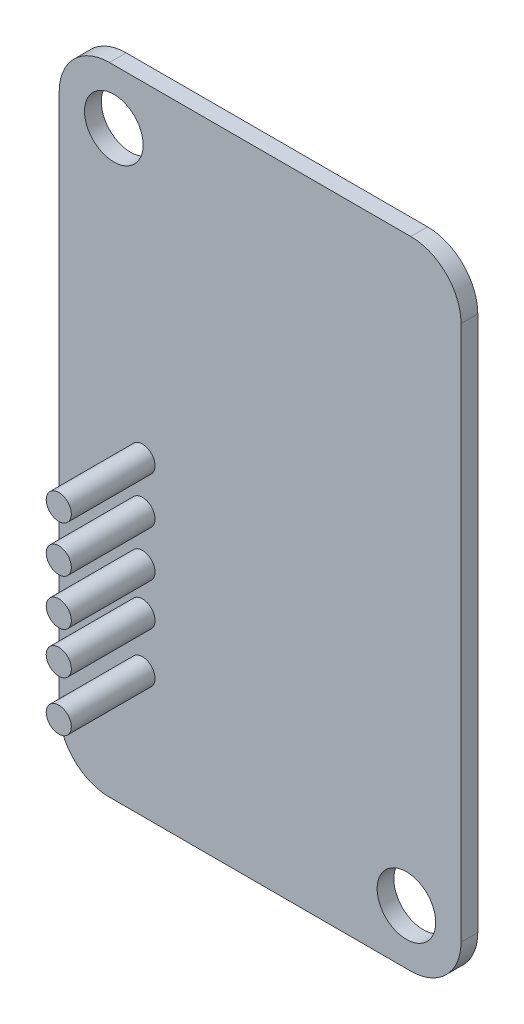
ISO-10303-21;
HEADER;
FILE_DESCRIPTION(('STEP AP214'),'2;1');
FILE_NAME('part.step','',(''),(''),'','','');
FILE_SCHEMA(('AUTOMOTIVE_DESIGN { 1 0 10303 214 1 1 1 1 }'));
ENDSEC;
DATA;
#1=APPLICATION_CONTEXT('core data for automotive mechanical design processes');
#2=APPLICATION_PROTOCOL_DEFINITION('international standard','automotive_design',2000,#1);
#3=PRODUCT_CONTEXT('',#1,'mechanical');
#4=PRODUCT('Part','Part','',(#3));
#5=PRODUCT_RELATED_PRODUCT_CATEGORY('part','',(#4));
#6=PRODUCT_DEFINITION_FORMATION('','',#4);
#7=PRODUCT_DEFINITION_CONTEXT('part definition',#1,'design');
#8=PRODUCT_DEFINITION('design','',#6,#7);
#9=PRODUCT_DEFINITION_SHAPE('','',#8);
#10=(LENGTH_UNIT() NAMED_UNIT(*) SI_UNIT(.MILLI.,.METRE.));
#11=(NAMED_UNIT(*) PLANE_ANGLE_UNIT() SI_UNIT($,.RADIAN.));
#12=(NAMED_UNIT(*) SI_UNIT($,.STERADIAN.) SOLID_ANGLE_UNIT());
#13=UNCERTAINTY_MEASURE_WITH_UNIT(LENGTH_MEASURE(1.E-05),#10,'distance_accuracy_value','');
#14=(GEOMETRIC_REPRESENTATION_CONTEXT(3) GLOBAL_UNCERTAINTY_ASSIGNED_CONTEXT((#13)) GLOBAL_UNIT_ASSIGNED_CONTEXT((#10,
#11,#12)) REPRESENTATION_CONTEXT('',''));
#15=CARTESIAN_POINT('',(0.,0.,0.));
#16=DIRECTION('',(0.,0.,1.));
#17=DIRECTION('',(1.,0.,0.));
#18=AXIS2_PLACEMENT_3D('',#15,#16,#17);
#19=CARTESIAN_POINT('',(0.,0.,0.));
#20=DIRECTION('',(0.,0.,-1.));
#21=DIRECTION('',(-1.,0.,0.));
#22=AXIS2_PLACEMENT_3D('',#19,#20,#21);
#23=PLANE('',#22);
#24=CARTESIAN_POINT('',(-7.02573050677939,-13.5,0.));
#25=DIRECTION('',(0.,0.,-1.));
#26=DIRECTION('',(-1.,0.,0.));
#27=AXIS2_PLACEMENT_3D('',#24,#25,#26);
#28=CIRCLE('',#27,0.75);
#29=CARTESIAN_POINT('',(-7.77573050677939,-13.5,0.));
#30=VERTEX_POINT('',#29);
#31=EDGE_CURVE('E11',#30,#30,#28,.T.);
#32=ORIENTED_EDGE('',*,*,#31,.F.);
#33=EDGE_LOOP('',(#32));
#34=FACE_BOUND('',#33,.T.);
#35=CARTESIAN_POINT('',(-7.02573050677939,-10.5078055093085,0.));
#36=DIRECTION('',(0.,0.,-1.));
#37=DIRECTION('',(-1.,0.,0.));
#38=AXIS2_PLACEMENT_3D('',#35,#36,#37);
#39=CIRCLE('',#38,0.750000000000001);
#40=CARTESIAN_POINT('',(-7.77573050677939,-10.5078055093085,0.));
#41=VERTEX_POINT('',#40);
#42=EDGE_CURVE('E42',#41,#41,#39,.T.);
#43=ORIENTED_EDGE('',*,*,#42,.F.);
#44=EDGE_LOOP('',(#43));
#45=FACE_BOUND('',#44,.T.);
#46=CARTESIAN_POINT('',(-7.02573050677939,-8.,0.));
#47=DIRECTION('',(0.,0.,-1.));
#48=DIRECTION('',(-1.,0.,0.));
#49=AXIS2_PLACEMENT_3D('',#46,#47,#48);
#50=CIRCLE('',#49,0.750000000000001);
#51=CARTESIAN_POINT('',(-7.77573050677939,-8.,0.));
#52=VERTEX_POINT('',#51);
#53=EDGE_CURVE('E403',#52,#52,#50,.T.);
#54=ORIENTED_EDGE('',*,*,#53,.F.);
#55=EDGE_LOOP('',(#54));
#56=FACE_BOUND('',#55,.T.);
#57=CARTESIAN_POINT('',(-7.02573050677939,-5.25566541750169,0.));
#58=DIRECTION('',(0.,0.,-1.));
#59=DIRECTION('',(-1.,0.,0.));
#60=AXIS2_PLACEMENT_3D('',#57,#58,#59);
#61=CIRCLE('',#60,0.749999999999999);
#62=CARTESIAN_POINT('',(-7.77573050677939,-5.25566541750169,0.));
#63=VERTEX_POINT('',#62);
#64=EDGE_CURVE('E409',#63,#63,#61,.T.);
#65=ORIENTED_EDGE('',*,*,#64,.F.);
#66=EDGE_LOOP('',(#65));
#67=FACE_BOUND('',#66,.T.);
#68=CARTESIAN_POINT('',(-7.02573050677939,-2.5,0.));
#69=DIRECTION('',(0.,0.,-1.));
#70=DIRECTION('',(-1.,0.,0.));
#71=AXIS2_PLACEMENT_3D('',#68,#69,#70);
#72=CIRCLE('',#71,0.749999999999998);
#73=CARTESIAN_POINT('',(-7.77573050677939,-2.5,0.));
#74=VERTEX_POINT('',#73);
#75=EDGE_CURVE('E371',#74,#74,#72,.T.);
#76=ORIENTED_EDGE('',*,*,#75,.F.);
#77=EDGE_LOOP('',(#76));
#78=FACE_BOUND('',#77,.T.);
#79=CARTESIAN_POINT('',(-8.73723825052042,13.7372382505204,0.));
#80=DIRECTION('',(0.,0.,-1.));
#81=DIRECTION('',(-1.,0.,0.));
#82=AXIS2_PLACEMENT_3D('',#79,#80,#81);
#83=CIRCLE('',#82,1.75);
#84=CARTESIAN_POINT('',(-10.4872382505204,13.7372382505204,0.));
#85=VERTEX_POINT('',#84);
#86=EDGE_CURVE('E425',#85,#85,#83,.T.);
#87=ORIENTED_EDGE('',*,*,#86,.F.);
#88=EDGE_LOOP('',(#87));
#89=FACE_BOUND('',#88,.T.);
#90=CARTESIAN_POINT('',(8.73723825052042,-17.7372382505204,0.));
#91=DIRECTION('',(0.,0.,-1.));
#92=DIRECTION('',(-1.,0.,0.));
#93=AXIS2_PLACEMENT_3D('',#90,#91,#92);
#94=CIRCLE('',#93,1.75);
#95=CARTESIAN_POINT('',(6.98723825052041,-17.7372382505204,0.));
#96=VERTEX_POINT('',#95);
#97=EDGE_CURVE('E375',#96,#96,#94,.T.);
#98=ORIENTED_EDGE('',*,*,#97,.F.);
#99=EDGE_LOOP('',(#98));
#100=FACE_BOUND('',#99,.T.);
#101=DIRECTION('',(1.,0.,0.));
#102=VECTOR('',#101,1.);
#103=CARTESIAN_POINT('',(-12.,-21.,0.));
#104=LINE('',#103,#102);
#105=CARTESIAN_POINT('',(-9.,-21.,0.));
#106=VERTEX_POINT('',#105);
#107=CARTESIAN_POINT('',(9.,-21.,0.));
#108=VERTEX_POINT('',#107);
#109=EDGE_CURVE('E331',#106,#108,#104,.T.);
#110=ORIENTED_EDGE('',*,*,#109,.F.);
#111=CARTESIAN_POINT('',(-9.,-18.,0.));
#112=DIRECTION('',(0.,0.,-1.));
#113=DIRECTION('',(-1.,0.,0.));
#114=AXIS2_PLACEMENT_3D('',#111,#112,#113);
#115=CIRCLE('',#114,3.);
#116=CARTESIAN_POINT('',(-12.,-18.,0.));
#117=VERTEX_POINT('',#116);
#118=EDGE_CURVE('E346',#106,#117,#115,.T.);
#119=ORIENTED_EDGE('',*,*,#118,.T.);
#120=DIRECTION('',(0.,-1.,0.));
#121=VECTOR('',#120,1.);
#122=CARTESIAN_POINT('',(-12.,17.,0.));
#123=LINE('',#122,#121);
#124=CARTESIAN_POINT('',(-12.,14.,0.));
#125=VERTEX_POINT('',#124);
#126=EDGE_CURVE('E328',#125,#117,#123,.T.);
#127=ORIENTED_EDGE('',*,*,#126,.F.);
#128=CARTESIAN_POINT('',(-9.,14.,0.));
#129=DIRECTION('',(0.,0.,-1.));
#130=DIRECTION('',(-1.,0.,0.));
#131=AXIS2_PLACEMENT_3D('',#128,#129,#130);
#132=CIRCLE('',#131,3.);
#133=CARTESIAN_POINT('',(-9.,17.,0.));
#134=VERTEX_POINT('',#133);
#135=EDGE_CURVE('E342',#125,#134,#132,.T.);
#136=ORIENTED_EDGE('',*,*,#135,.T.);
#137=DIRECTION('',(-1.,0.,0.));
#138=VECTOR('',#137,1.);
#139=CARTESIAN_POINT('',(-12.,17.,0.));
#140=LINE('',#139,#138);
#141=CARTESIAN_POINT('',(9.,17.,0.));
#142=VERTEX_POINT('',#141);
#143=EDGE_CURVE('E311',#142,#134,#140,.T.);
#144=ORIENTED_EDGE('',*,*,#143,.F.);
#145=CARTESIAN_POINT('',(9.,14.,0.));
#146=DIRECTION('',(0.,0.,-1.));
#147=DIRECTION('',(-1.,0.,0.));
#148=AXIS2_PLACEMENT_3D('',#145,#146,#147);
#149=CIRCLE('',#148,3.);
#150=CARTESIAN_POINT('',(12.,14.,0.));
#151=VERTEX_POINT('',#150);
#152=EDGE_CURVE('E340',#142,#151,#149,.T.);
#153=ORIENTED_EDGE('',*,*,#152,.T.);
#154=DIRECTION('',(0.,1.,0.));
#155=VECTOR('',#154,1.);
#156=CARTESIAN_POINT('',(12.,17.,0.));
#157=LINE('',#156,#155);
#158=CARTESIAN_POINT('',(12.,-18.,0.));
#159=VERTEX_POINT('',#158);
#160=EDGE_CURVE('E316',#159,#151,#157,.T.);
#161=ORIENTED_EDGE('',*,*,#160,.F.);
#162=CARTESIAN_POINT('',(9.,-18.,0.));
#163=DIRECTION('',(0.,0.,-1.));
#164=DIRECTION('',(-1.,0.,0.));
#165=AXIS2_PLACEMENT_3D('',#162,#163,#164);
#166=CIRCLE('',#165,3.);
#167=EDGE_CURVE('E344',#159,#108,#166,.T.);
#168=ORIENTED_EDGE('',*,*,#167,.T.);
#169=EDGE_LOOP('',(#110,#119,#127,#136,#144,#153,#161,#168));
#170=FACE_BOUND('',#169,.T.);
#171=DIRECTION('',(0.,-1.,0.));
#172=VECTOR('',#171,1.);
#173=CARTESIAN_POINT('',(-3.,1.5,0.));
#174=LINE('',#173,#172);
#175=CARTESIAN_POINT('',(-3.,1.5,0.));
#176=VERTEX_POINT('',#175);
#177=CARTESIAN_POINT('',(-3.,-1.5,0.));
#178=VERTEX_POINT('',#177);
#179=EDGE_CURVE('E296',#176,#178,#174,.T.);
#180=ORIENTED_EDGE('',*,*,#179,.F.);
#181=DIRECTION('',(1.,0.,0.));
#182=VECTOR('',#181,1.);
#183=CARTESIAN_POINT('',(-3.,1.5,0.));
#184=LINE('',#183,#182);
#185=CARTESIAN_POINT('',(-7.,1.5,0.));
#186=VERTEX_POINT('',#185);
#187=EDGE_CURVE('E282',#186,#176,#184,.T.);
#188=ORIENTED_EDGE('',*,*,#187,.F.);
#189=DIRECTION('',(0.,1.,0.));
#190=VECTOR('',#189,1.);
#191=CARTESIAN_POINT('',(-7.,1.5,0.));
#192=LINE('',#191,#190);
#193=CARTESIAN_POINT('',(-7.,-1.5,0.));
#194=VERTEX_POINT('',#193);
#195=EDGE_CURVE('E287',#194,#186,#192,.T.);
#196=ORIENTED_EDGE('',*,*,#195,.F.);
#197=DIRECTION('',(-1.,0.,0.));
#198=VECTOR('',#197,1.);
#199=CARTESIAN_POINT('',(-3.,-1.5,0.));
#200=LINE('',#199,#198);
#201=EDGE_CURVE('E298',#178,#194,#200,.T.);
#202=ORIENTED_EDGE('',*,*,#201,.F.);
#203=EDGE_LOOP('',(#180,#188,#196,#202));
#204=FACE_BOUND('',#203,.T.);
#205=DIRECTION('',(-1.,0.,0.));
#206=VECTOR('',#205,1.);
#207=CARTESIAN_POINT('',(1.5,3.,0.));
#208=LINE('',#207,#206);
#209=CARTESIAN_POINT('',(1.5,3.,0.));
#210=VERTEX_POINT('',#209);
#211=CARTESIAN_POINT('',(-1.5,3.,0.));
#212=VERTEX_POINT('',#211);
#213=EDGE_CURVE('E267',#210,#212,#208,.T.);
#214=ORIENTED_EDGE('',*,*,#213,.F.);
#215=DIRECTION('',(0.,-1.,0.));
#216=VECTOR('',#215,1.);
#217=CARTESIAN_POINT('',(1.5,3.,0.));
#218=LINE('',#217,#216);
#219=CARTESIAN_POINT('',(1.5,7.,0.));
#220=VERTEX_POINT('',#219);
#221=EDGE_CURVE('E253',#220,#210,#218,.T.);
#222=ORIENTED_EDGE('',*,*,#221,.F.);
#223=DIRECTION('',(1.,0.,0.));
#224=VECTOR('',#223,1.);
#225=CARTESIAN_POINT('',(1.5,7.,0.));
#226=LINE('',#225,#224);
#227=CARTESIAN_POINT('',(-1.5,7.,0.));
#228=VERTEX_POINT('',#227);
#229=EDGE_CURVE('E258',#228,#220,#226,.T.);
#230=ORIENTED_EDGE('',*,*,#229,.F.);
#231=DIRECTION('',(0.,1.,0.));
#232=VECTOR('',#231,1.);
#233=CARTESIAN_POINT('',(-1.5,3.,0.));
#234=LINE('',#233,#232);
#235=EDGE_CURVE('E269',#212,#228,#234,.T.);
#236=ORIENTED_EDGE('',*,*,#235,.F.);
#237=EDGE_LOOP('',(#214,#222,#230,#236));
#238=FACE_BOUND('',#237,.T.);
#239=DIRECTION('',(0.,-1.,0.));
#240=VECTOR('',#239,1.);
#241=CARTESIAN_POINT('',(7.,1.5,0.));
#242=LINE('',#241,#240);
#243=CARTESIAN_POINT('',(7.,1.5,0.));
#244=VERTEX_POINT('',#243);
#245=CARTESIAN_POINT('',(7.,-1.5,0.));
#246=VERTEX_POINT('',#245);
#247=EDGE_CURVE('E225',#244,#246,#242,.T.);
#248=ORIENTED_EDGE('',*,*,#247,.F.);
#249=DIRECTION('',(1.,0.,0.));
#250=VECTOR('',#249,1.);
#251=CARTESIAN_POINT('',(3.,1.5,0.));
#252=LINE('',#251,#250);
#253=CARTESIAN_POINT('',(3.,1.5,0.));
#254=VERTEX_POINT('',#253);
#255=EDGE_CURVE('E222',#254,#244,#252,.T.);
#256=ORIENTED_EDGE('',*,*,#255,.F.);
#257=DIRECTION('',(0.,1.,0.));
#258=VECTOR('',#257,1.);
#259=CARTESIAN_POINT('',(3.,1.5,0.));
#260=LINE('',#259,#258);
#261=CARTESIAN_POINT('',(3.,-1.5,0.));
#262=VERTEX_POINT('',#261);
#263=EDGE_CURVE('E234',#262,#254,#260,.T.);
#264=ORIENTED_EDGE('',*,*,#263,.F.);
#265=DIRECTION('',(-1.,0.,0.));
#266=VECTOR('',#265,1.);
#267=CARTESIAN_POINT('',(3.,-1.5,0.));
#268=LINE('',#267,#266);
#269=EDGE_CURVE('E242',#246,#262,#268,.T.);
#270=ORIENTED_EDGE('',*,*,#269,.F.);
#271=EDGE_LOOP('',(#248,#256,#264,#270));
#272=FACE_BOUND('',#271,.T.);
#273=DIRECTION('',(-1.,0.,0.));
#274=VECTOR('',#273,1.);
#275=CARTESIAN_POINT('',(1.5,-7.,0.));
#276=LINE('',#275,#274);
#277=CARTESIAN_POINT('',(1.5,-7.,0.));
#278=VERTEX_POINT('',#277);
#279=CARTESIAN_POINT('',(-1.5,-7.,0.));
#280=VERTEX_POINT('',#279);
#281=EDGE_CURVE('E437',#278,#280,#276,.T.);
#282=ORIENTED_EDGE('',*,*,#281,.F.);
#283=DIRECTION('',(0.,-1.,0.));
#284=VECTOR('',#283,1.);
#285=CARTESIAN_POINT('',(1.5,-3.,0.));
#286=LINE('',#285,#284);
#287=CARTESIAN_POINT('',(1.5,-3.,0.));
#288=VERTEX_POINT('',#287);
#289=EDGE_CURVE('E220',#288,#278,#286,.T.);
#290=ORIENTED_EDGE('',*,*,#289,.F.);
#291=DIRECTION('',(1.,0.,0.));
#292=VECTOR('',#291,1.);
#293=CARTESIAN_POINT('',(1.5,-3.,0.));
#294=LINE('',#293,#292);
#295=CARTESIAN_POINT('',(-1.5,-3.,0.));
#296=VERTEX_POINT('',#295);
#297=EDGE_CURVE('E216',#296,#288,#294,.T.);
#298=ORIENTED_EDGE('',*,*,#297,.F.);
#299=DIRECTION('',(0.,1.,0.));
#300=VECTOR('',#299,1.);
#301=CARTESIAN_POINT('',(-1.5,-3.,0.));
#302=LINE('',#301,#300);
#303=EDGE_CURVE('E439',#280,#296,#302,.T.);
#304=ORIENTED_EDGE('',*,*,#303,.F.);
#305=EDGE_LOOP('',(#282,#290,#298,#304));
#306=FACE_BOUND('',#305,.T.);
#307=ADVANCED_FACE('F33',(#34,#45,#56,#67,#78,#89,#100,#170,#204,#238,#272,#306),#23,.T.);
#308=CARTESIAN_POINT('',(-12.,17.,1.));
#309=DIRECTION('',(0.,-1.,0.));
#310=DIRECTION('',(1.,0.,0.));
#311=AXIS2_PLACEMENT_3D('',#308,#309,#310);
#312=PLANE('',#311);
#313=ORIENTED_EDGE('',*,*,#143,.T.);
#314=DIRECTION('',(0.,0.,-1.));
#315=VECTOR('',#314,1.);
#316=CARTESIAN_POINT('',(-9.,17.,1.));
#317=LINE('',#316,#315);
#318=CARTESIAN_POINT('',(-9.,17.,1.));
#319=VERTEX_POINT('',#318);
#320=EDGE_CURVE('E369',#134,#319,#317,.F.);
#321=ORIENTED_EDGE('',*,*,#320,.T.);
#322=DIRECTION('',(-1.,0.,0.));
#323=VECTOR('',#322,1.);
#324=CARTESIAN_POINT('',(-12.,17.,1.));
#325=LINE('',#324,#323);
#326=CARTESIAN_POINT('',(9.,17.,1.));
#327=VERTEX_POINT('',#326);
#328=EDGE_CURVE('E312',#327,#319,#325,.T.);
#329=ORIENTED_EDGE('',*,*,#328,.F.);
#330=DIRECTION('',(0.,0.,-1.));
#331=VECTOR('',#330,1.);
#332=CARTESIAN_POINT('',(9.,17.,1.));
#333=LINE('',#332,#331);
#334=EDGE_CURVE('E366',#327,#142,#333,.T.);
#335=ORIENTED_EDGE('',*,*,#334,.T.);
#336=EDGE_LOOP('',(#313,#321,#329,#335));
#337=FACE_BOUND('',#336,.T.);
#338=ADVANCED_FACE('F458',(#337),#312,.F.);
#339=CARTESIAN_POINT('',(-12.,17.,1.));
#340=DIRECTION('',(1.,0.,0.));
#341=DIRECTION('',(0.,1.,0.));
#342=AXIS2_PLACEMENT_3D('',#339,#340,#341);
#343=PLANE('',#342);
#344=ORIENTED_EDGE('',*,*,#126,.T.);
#345=DIRECTION('',(0.,0.,-1.));
#346=VECTOR('',#345,1.);
#347=CARTESIAN_POINT('',(-12.,-18.,1.));
#348=LINE('',#347,#346);
#349=CARTESIAN_POINT('',(-12.,-18.,1.));
#350=VERTEX_POINT('',#349);
#351=EDGE_CURVE('E351',#117,#350,#348,.F.);
#352=ORIENTED_EDGE('',*,*,#351,.T.);
#353=DIRECTION('',(0.,-1.,0.));
#354=VECTOR('',#353,1.);
#355=CARTESIAN_POINT('',(-12.,17.,1.));
#356=LINE('',#355,#354);
#357=CARTESIAN_POINT('',(-12.,14.,1.));
#358=VERTEX_POINT('',#357);
#359=EDGE_CURVE('E315',#358,#350,#356,.T.);
#360=ORIENTED_EDGE('',*,*,#359,.F.);
#361=DIRECTION('',(0.,0.,-1.));
#362=VECTOR('',#361,1.);
#363=CARTESIAN_POINT('',(-12.,14.,1.));
#364=LINE('',#363,#362);
#365=EDGE_CURVE('E348',#358,#125,#364,.T.);
#366=ORIENTED_EDGE('',*,*,#365,.T.);
#367=EDGE_LOOP('',(#344,#352,#360,#366));
#368=FACE_BOUND('',#367,.T.);
#369=ADVANCED_FACE('F466',(#368),#343,.F.);
#370=CARTESIAN_POINT('',(-12.,-21.,1.));
#371=DIRECTION('',(0.,1.,0.));
#372=DIRECTION('',(-1.,0.,0.));
#373=AXIS2_PLACEMENT_3D('',#370,#371,#372);
#374=PLANE('',#373);
#375=DIRECTION('',(1.,0.,0.));
#376=VECTOR('',#375,1.);
#377=CARTESIAN_POINT('',(-12.,-21.,1.));
#378=LINE('',#377,#376);
#379=CARTESIAN_POINT('',(-9.,-21.,1.));
#380=VERTEX_POINT('',#379);
#381=CARTESIAN_POINT('',(9.,-21.,1.));
#382=VERTEX_POINT('',#381);
#383=EDGE_CURVE('E319',#380,#382,#378,.T.);
#384=ORIENTED_EDGE('',*,*,#383,.F.);
#385=DIRECTION('',(0.,0.,-1.));
#386=VECTOR('',#385,1.);
#387=CARTESIAN_POINT('',(-9.,-21.,1.));
#388=LINE('',#387,#386);
#389=EDGE_CURVE('E337',#380,#106,#388,.T.);
#390=ORIENTED_EDGE('',*,*,#389,.T.);
#391=ORIENTED_EDGE('',*,*,#109,.T.);
#392=DIRECTION('',(0.,0.,-1.));
#393=VECTOR('',#392,1.);
#394=CARTESIAN_POINT('',(9.,-21.,1.));
#395=LINE('',#394,#393);
#396=EDGE_CURVE('E325',#108,#382,#395,.F.);
#397=ORIENTED_EDGE('',*,*,#396,.T.);
#398=EDGE_LOOP('',(#384,#390,#391,#397));
#399=FACE_BOUND('',#398,.T.);
#400=ADVANCED_FACE('F478',(#399),#374,.F.);
#401=CARTESIAN_POINT('',(12.,17.,1.));
#402=DIRECTION('',(-1.,0.,0.));
#403=DIRECTION('',(0.,-1.,0.));
#404=AXIS2_PLACEMENT_3D('',#401,#402,#403);
#405=PLANE('',#404);
#406=DIRECTION('',(0.,1.,0.));
#407=VECTOR('',#406,1.);
#408=CARTESIAN_POINT('',(12.,17.,1.));
#409=LINE('',#408,#407);
#410=CARTESIAN_POINT('',(12.,-18.,1.));
#411=VERTEX_POINT('',#410);
#412=CARTESIAN_POINT('',(12.,14.,1.));
#413=VERTEX_POINT('',#412);
#414=EDGE_CURVE('E322',#411,#413,#409,.T.);
#415=ORIENTED_EDGE('',*,*,#414,.F.);
#416=DIRECTION('',(0.,0.,-1.));
#417=VECTOR('',#416,1.);
#418=CARTESIAN_POINT('',(12.,-18.,1.));
#419=LINE('',#418,#417);
#420=EDGE_CURVE('E363',#411,#159,#419,.T.);
#421=ORIENTED_EDGE('',*,*,#420,.T.);
#422=ORIENTED_EDGE('',*,*,#160,.T.);
#423=DIRECTION('',(0.,0.,-1.));
#424=VECTOR('',#423,1.);
#425=CARTESIAN_POINT('',(12.,14.,1.));
#426=LINE('',#425,#424);
#427=EDGE_CURVE('E361',#151,#413,#426,.F.);
#428=ORIENTED_EDGE('',*,*,#427,.T.);
#429=EDGE_LOOP('',(#415,#421,#422,#428));
#430=FACE_BOUND('',#429,.T.);
#431=ADVANCED_FACE('F475',(#430),#405,.F.);
#432=CARTESIAN_POINT('',(0.,0.,1.));
#433=DIRECTION('',(0.,0.,-1.));
#434=DIRECTION('',(-1.,0.,0.));
#435=AXIS2_PLACEMENT_3D('',#432,#433,#434);
#436=PLANE('',#435);
#437=CARTESIAN_POINT('',(-7.02573050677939,-13.5,1.));
#438=DIRECTION('',(0.,0.,-1.));
#439=DIRECTION('',(-1.,0.,0.));
#440=AXIS2_PLACEMENT_3D('',#437,#438,#439);
#441=CIRCLE('',#440,0.75);
#442=CARTESIAN_POINT('',(-7.77573050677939,-13.5,1.));
#443=VERTEX_POINT('',#442);
#444=EDGE_CURVE('E37',#443,#443,#441,.T.);
#445=ORIENTED_EDGE('',*,*,#444,.T.);
#446=EDGE_LOOP('',(#445));
#447=FACE_BOUND('',#446,.T.);
#448=CARTESIAN_POINT('',(-7.02573050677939,-10.5078055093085,1.));
#449=DIRECTION('',(0.,0.,-1.));
#450=DIRECTION('',(-1.,0.,0.));
#451=AXIS2_PLACEMENT_3D('',#448,#449,#450);
#452=CIRCLE('',#451,0.750000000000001);
#453=CARTESIAN_POINT('',(-7.77573050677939,-10.5078055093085,1.));
#454=VERTEX_POINT('',#453);
#455=EDGE_CURVE('E386',#454,#454,#452,.T.);
#456=ORIENTED_EDGE('',*,*,#455,.T.);
#457=EDGE_LOOP('',(#456));
#458=FACE_BOUND('',#457,.T.);
#459=CARTESIAN_POINT('',(-7.02573050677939,-8.,1.));
#460=DIRECTION('',(0.,0.,-1.));
#461=DIRECTION('',(-1.,0.,0.));
#462=AXIS2_PLACEMENT_3D('',#459,#460,#461);
#463=CIRCLE('',#462,0.750000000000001);
#464=CARTESIAN_POINT('',(-7.77573050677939,-8.,1.));
#465=VERTEX_POINT('',#464);
#466=EDGE_CURVE('E382',#465,#465,#463,.T.);
#467=ORIENTED_EDGE('',*,*,#466,.T.);
#468=EDGE_LOOP('',(#467));
#469=FACE_BOUND('',#468,.T.);
#470=CARTESIAN_POINT('',(-7.02573050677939,-5.25566541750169,1.));
#471=DIRECTION('',(0.,0.,-1.));
#472=DIRECTION('',(-1.,0.,0.));
#473=AXIS2_PLACEMENT_3D('',#470,#471,#472);
#474=CIRCLE('',#473,0.749999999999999);
#475=CARTESIAN_POINT('',(-7.77573050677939,-5.25566541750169,1.));
#476=VERTEX_POINT('',#475);
#477=EDGE_CURVE('E377',#476,#476,#474,.T.);
#478=ORIENTED_EDGE('',*,*,#477,.T.);
#479=EDGE_LOOP('',(#478));
#480=FACE_BOUND('',#479,.T.);
#481=CARTESIAN_POINT('',(-7.02573050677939,-2.5,1.));
#482=DIRECTION('',(0.,0.,-1.));
#483=DIRECTION('',(-1.,0.,0.));
#484=AXIS2_PLACEMENT_3D('',#481,#482,#483);
#485=CIRCLE('',#484,0.749999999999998);
#486=CARTESIAN_POINT('',(-7.77573050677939,-2.5,1.));
#487=VERTEX_POINT('',#486);
#488=EDGE_CURVE('E372',#487,#487,#485,.T.);
#489=ORIENTED_EDGE('',*,*,#488,.T.);
#490=EDGE_LOOP('',(#489));
#491=FACE_BOUND('',#490,.T.);
#492=CARTESIAN_POINT('',(-8.73723825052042,13.7372382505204,1.));
#493=DIRECTION('',(0.,0.,-1.));
#494=DIRECTION('',(-1.,0.,0.));
#495=AXIS2_PLACEMENT_3D('',#492,#493,#494);
#496=CIRCLE('',#495,1.75);
#497=CARTESIAN_POINT('',(-10.4872382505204,13.7372382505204,1.));
#498=VERTEX_POINT('',#497);
#499=EDGE_CURVE('E422',#498,#498,#496,.T.);
#500=ORIENTED_EDGE('',*,*,#499,.T.);
#501=EDGE_LOOP('',(#500));
#502=FACE_BOUND('',#501,.T.);
#503=CARTESIAN_POINT('',(8.73723825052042,-17.7372382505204,1.));
#504=DIRECTION('',(0.,0.,-1.));
#505=DIRECTION('',(-1.,0.,0.));
#506=AXIS2_PLACEMENT_3D('',#503,#504,#505);
#507=CIRCLE('',#506,1.75);
#508=CARTESIAN_POINT('',(6.98723825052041,-17.7372382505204,1.));
#509=VERTEX_POINT('',#508);
#510=EDGE_CURVE('E428',#509,#509,#507,.T.);
#511=ORIENTED_EDGE('',*,*,#510,.T.);
#512=EDGE_LOOP('',(#511));
#513=FACE_BOUND('',#512,.T.);
#514=ORIENTED_EDGE('',*,*,#359,.T.);
#515=CARTESIAN_POINT('',(-9.,-18.,1.));
#516=DIRECTION('',(0.,0.,-1.));
#517=DIRECTION('',(-1.,0.,0.));
#518=AXIS2_PLACEMENT_3D('',#515,#516,#517);
#519=CIRCLE('',#518,3.);
#520=EDGE_CURVE('E359',#350,#380,#519,.F.);
#521=ORIENTED_EDGE('',*,*,#520,.T.);
#522=ORIENTED_EDGE('',*,*,#383,.T.);
#523=CARTESIAN_POINT('',(9.,-18.,1.));
#524=DIRECTION('',(0.,0.,-1.));
#525=DIRECTION('',(-1.,0.,0.));
#526=AXIS2_PLACEMENT_3D('',#523,#524,#525);
#527=CIRCLE('',#526,3.);
#528=EDGE_CURVE('E357',#382,#411,#527,.F.);
#529=ORIENTED_EDGE('',*,*,#528,.T.);
#530=ORIENTED_EDGE('',*,*,#414,.T.);
#531=CARTESIAN_POINT('',(9.,14.,1.));
#532=DIRECTION('',(0.,0.,-1.));
#533=DIRECTION('',(-1.,0.,0.));
#534=AXIS2_PLACEMENT_3D('',#531,#532,#533);
#535=CIRCLE('',#534,3.);
#536=EDGE_CURVE('E353',#413,#327,#535,.F.);
#537=ORIENTED_EDGE('',*,*,#536,.T.);
#538=ORIENTED_EDGE('',*,*,#328,.T.);
#539=CARTESIAN_POINT('',(-9.,14.,1.));
#540=DIRECTION('',(0.,0.,-1.));
#541=DIRECTION('',(-1.,0.,0.));
#542=AXIS2_PLACEMENT_3D('',#539,#540,#541);
#543=CIRCLE('',#542,3.);
#544=EDGE_CURVE('E355',#319,#358,#543,.F.);
#545=ORIENTED_EDGE('',*,*,#544,.T.);
#546=EDGE_LOOP('',(#514,#521,#522,#529,#530,#537,#538,#545));
#547=FACE_BOUND('',#546,.T.);
#548=ADVANCED_FACE('F473',(#447,#458,#469,#480,#491,#502,#513,#547),#436,.F.);
#549=CARTESIAN_POINT('',(-9.,-18.,1.));
#550=DIRECTION('',(0.,0.,-1.));
#551=DIRECTION('',(-1.,0.,0.));
#552=AXIS2_PLACEMENT_3D('',#549,#550,#551);
#553=CYLINDRICAL_SURFACE('',#552,3.);
#554=ORIENTED_EDGE('',*,*,#520,.F.);
#555=ORIENTED_EDGE('',*,*,#351,.F.);
#556=ORIENTED_EDGE('',*,*,#118,.F.);
#557=ORIENTED_EDGE('',*,*,#389,.F.);
#558=EDGE_LOOP('',(#554,#555,#556,#557));
#559=FACE_BOUND('',#558,.T.);
#560=ADVANCED_FACE('F486',(#559),#553,.T.);
#561=CARTESIAN_POINT('',(9.,-18.,1.));
#562=DIRECTION('',(0.,0.,-1.));
#563=DIRECTION('',(-1.,0.,0.));
#564=AXIS2_PLACEMENT_3D('',#561,#562,#563);
#565=CYLINDRICAL_SURFACE('',#564,3.);
#566=ORIENTED_EDGE('',*,*,#528,.F.);
#567=ORIENTED_EDGE('',*,*,#396,.F.);
#568=ORIENTED_EDGE('',*,*,#167,.F.);
#569=ORIENTED_EDGE('',*,*,#420,.F.);
#570=EDGE_LOOP('',(#566,#567,#568,#569));
#571=FACE_BOUND('',#570,.T.);
#572=ADVANCED_FACE('F489',(#571),#565,.T.);
#573=CARTESIAN_POINT('',(-9.,14.,1.));
#574=DIRECTION('',(0.,0.,-1.));
#575=DIRECTION('',(-1.,0.,0.));
#576=AXIS2_PLACEMENT_3D('',#573,#574,#575);
#577=CYLINDRICAL_SURFACE('',#576,3.);
#578=ORIENTED_EDGE('',*,*,#544,.F.);
#579=ORIENTED_EDGE('',*,*,#320,.F.);
#580=ORIENTED_EDGE('',*,*,#135,.F.);
#581=ORIENTED_EDGE('',*,*,#365,.F.);
#582=EDGE_LOOP('',(#578,#579,#580,#581));
#583=FACE_BOUND('',#582,.T.);
#584=ADVANCED_FACE('F492',(#583),#577,.T.);
#585=CARTESIAN_POINT('',(9.,14.,1.));
#586=DIRECTION('',(0.,0.,-1.));
#587=DIRECTION('',(-1.,0.,0.));
#588=AXIS2_PLACEMENT_3D('',#585,#586,#587);
#589=CYLINDRICAL_SURFACE('',#588,3.);
#590=ORIENTED_EDGE('',*,*,#536,.F.);
#591=ORIENTED_EDGE('',*,*,#427,.F.);
#592=ORIENTED_EDGE('',*,*,#152,.F.);
#593=ORIENTED_EDGE('',*,*,#334,.F.);
#594=EDGE_LOOP('',(#590,#591,#592,#593));
#595=FACE_BOUND('',#594,.T.);
#596=ADVANCED_FACE('F35',(#595),#589,.T.);
#597=CARTESIAN_POINT('',(-3.,1.5,-2.));
#598=DIRECTION('',(0.,-1.,0.));
#599=DIRECTION('',(1.,0.,0.));
#600=AXIS2_PLACEMENT_3D('',#597,#598,#599);
#601=PLANE('',#600);
#602=ORIENTED_EDGE('',*,*,#187,.T.);
#603=DIRECTION('',(0.,0.,1.));
#604=VECTOR('',#603,1.);
#605=CARTESIAN_POINT('',(-3.,1.5,-2.));
#606=LINE('',#605,#604);
#607=CARTESIAN_POINT('',(-3.,1.5,-2.));
#608=VERTEX_POINT('',#607);
#609=EDGE_CURVE('E309',#608,#176,#606,.T.);
#610=ORIENTED_EDGE('',*,*,#609,.F.);
#611=DIRECTION('',(1.,0.,0.));
#612=VECTOR('',#611,1.);
#613=CARTESIAN_POINT('',(-3.,1.5,-2.));
#614=LINE('',#613,#612);
#615=CARTESIAN_POINT('',(-7.,1.5,-2.));
#616=VERTEX_POINT('',#615);
#617=EDGE_CURVE('E283',#616,#608,#614,.T.);
#618=ORIENTED_EDGE('',*,*,#617,.F.);
#619=DIRECTION('',(0.,0.,1.));
#620=VECTOR('',#619,1.);
#621=CARTESIAN_POINT('',(-7.,1.5,-2.));
#622=LINE('',#621,#620);
#623=EDGE_CURVE('E293',#616,#186,#622,.T.);
#624=ORIENTED_EDGE('',*,*,#623,.T.);
#625=EDGE_LOOP('',(#602,#610,#618,#624));
#626=FACE_BOUND('',#625,.T.);
#627=ADVANCED_FACE('F499',(#626),#601,.F.);
#628=CARTESIAN_POINT('',(-3.,1.5,-2.));
#629=DIRECTION('',(-1.,0.,0.));
#630=DIRECTION('',(0.,-1.,0.));
#631=AXIS2_PLACEMENT_3D('',#628,#629,#630);
#632=PLANE('',#631);
#633=ORIENTED_EDGE('',*,*,#179,.T.);
#634=DIRECTION('',(0.,0.,1.));
#635=VECTOR('',#634,1.);
#636=CARTESIAN_POINT('',(-3.,-1.5,-2.));
#637=LINE('',#636,#635);
#638=CARTESIAN_POINT('',(-3.,-1.5,-2.));
#639=VERTEX_POINT('',#638);
#640=EDGE_CURVE('E306',#639,#178,#637,.T.);
#641=ORIENTED_EDGE('',*,*,#640,.F.);
#642=DIRECTION('',(0.,-1.,0.));
#643=VECTOR('',#642,1.);
#644=CARTESIAN_POINT('',(-3.,1.5,-2.));
#645=LINE('',#644,#643);
#646=EDGE_CURVE('E286',#608,#639,#645,.T.);
#647=ORIENTED_EDGE('',*,*,#646,.F.);
#648=ORIENTED_EDGE('',*,*,#609,.T.);
#649=EDGE_LOOP('',(#633,#641,#647,#648));
#650=FACE_BOUND('',#649,.T.);
#651=ADVANCED_FACE('F595',(#650),#632,.F.);
#652=CARTESIAN_POINT('',(-3.,-1.5,-2.));
#653=DIRECTION('',(0.,1.,0.));
#654=DIRECTION('',(-1.,0.,0.));
#655=AXIS2_PLACEMENT_3D('',#652,#653,#654);
#656=PLANE('',#655);
#657=ORIENTED_EDGE('',*,*,#201,.T.);
#658=DIRECTION('',(0.,0.,1.));
#659=VECTOR('',#658,1.);
#660=CARTESIAN_POINT('',(-7.,-1.5,-2.));
#661=LINE('',#660,#659);
#662=CARTESIAN_POINT('',(-7.,-1.5,-2.));
#663=VERTEX_POINT('',#662);
#664=EDGE_CURVE('E304',#663,#194,#661,.T.);
#665=ORIENTED_EDGE('',*,*,#664,.F.);
#666=DIRECTION('',(-1.,0.,0.));
#667=VECTOR('',#666,1.);
#668=CARTESIAN_POINT('',(-3.,-1.5,-2.));
#669=LINE('',#668,#667);
#670=EDGE_CURVE('E289',#639,#663,#669,.T.);
#671=ORIENTED_EDGE('',*,*,#670,.F.);
#672=ORIENTED_EDGE('',*,*,#640,.T.);
#673=EDGE_LOOP('',(#657,#665,#671,#672));
#674=FACE_BOUND('',#673,.T.);
#675=ADVANCED_FACE('F591',(#674),#656,.F.);
#676=CARTESIAN_POINT('',(-7.,1.5,-2.));
#677=DIRECTION('',(1.,0.,0.));
#678=DIRECTION('',(0.,0.,-1.));
#679=AXIS2_PLACEMENT_3D('',#676,#677,#678);
#680=PLANE('',#679);
#681=ORIENTED_EDGE('',*,*,#195,.T.);
#682=ORIENTED_EDGE('',*,*,#623,.F.);
#683=DIRECTION('',(0.,1.,0.));
#684=VECTOR('',#683,1.);
#685=CARTESIAN_POINT('',(-7.,1.5,-2.));
#686=LINE('',#685,#684);
#687=EDGE_CURVE('E291',#663,#616,#686,.T.);
#688=ORIENTED_EDGE('',*,*,#687,.F.);
#689=ORIENTED_EDGE('',*,*,#664,.T.);
#690=EDGE_LOOP('',(#681,#682,#688,#689));
#691=FACE_BOUND('',#690,.T.);
#692=ADVANCED_FACE('F587',(#691),#680,.F.);
#693=CARTESIAN_POINT('',(0.,0.,-2.));
#694=DIRECTION('',(0.,0.,1.));
#695=DIRECTION('',(1.,0.,0.));
#696=AXIS2_PLACEMENT_3D('',#693,#694,#695);
#697=PLANE('',#696);
#698=ORIENTED_EDGE('',*,*,#617,.T.);
#699=ORIENTED_EDGE('',*,*,#646,.T.);
#700=ORIENTED_EDGE('',*,*,#670,.T.);
#701=ORIENTED_EDGE('',*,*,#687,.T.);
#702=EDGE_LOOP('',(#698,#699,#700,#701));
#703=FACE_BOUND('',#702,.T.);
#704=ADVANCED_FACE('F583',(#703),#697,.F.);
#705=CARTESIAN_POINT('',(1.5,3.,-2.));
#706=DIRECTION('',(-1.,0.,0.));
#707=DIRECTION('',(0.,-1.,0.));
#708=AXIS2_PLACEMENT_3D('',#705,#706,#707);
#709=PLANE('',#708);
#710=ORIENTED_EDGE('',*,*,#221,.T.);
#711=DIRECTION('',(0.,0.,1.));
#712=VECTOR('',#711,1.);
#713=CARTESIAN_POINT('',(1.5,3.,-2.));
#714=LINE('',#713,#712);
#715=CARTESIAN_POINT('',(1.5,3.,-2.));
#716=VERTEX_POINT('',#715);
#717=EDGE_CURVE('E280',#716,#210,#714,.T.);
#718=ORIENTED_EDGE('',*,*,#717,.F.);
#719=DIRECTION('',(0.,-1.,0.));
#720=VECTOR('',#719,1.);
#721=CARTESIAN_POINT('',(1.5,3.,-2.));
#722=LINE('',#721,#720);
#723=CARTESIAN_POINT('',(1.5,7.,-2.));
#724=VERTEX_POINT('',#723);
#725=EDGE_CURVE('E254',#724,#716,#722,.T.);
#726=ORIENTED_EDGE('',*,*,#725,.F.);
#727=DIRECTION('',(0.,0.,1.));
#728=VECTOR('',#727,1.);
#729=CARTESIAN_POINT('',(1.5,7.,-2.));
#730=LINE('',#729,#728);
#731=EDGE_CURVE('E264',#724,#220,#730,.T.);
#732=ORIENTED_EDGE('',*,*,#731,.T.);
#733=EDGE_LOOP('',(#710,#718,#726,#732));
#734=FACE_BOUND('',#733,.T.);
#735=ADVANCED_FACE('F579',(#734),#709,.F.);
#736=CARTESIAN_POINT('',(1.5,3.,-2.));
#737=DIRECTION('',(0.,1.,0.));
#738=DIRECTION('',(-1.,0.,0.));
#739=AXIS2_PLACEMENT_3D('',#736,#737,#738);
#740=PLANE('',#739);
#741=ORIENTED_EDGE('',*,*,#213,.T.);
#742=DIRECTION('',(0.,0.,1.));
#743=VECTOR('',#742,1.);
#744=CARTESIAN_POINT('',(-1.5,3.,-2.));
#745=LINE('',#744,#743);
#746=CARTESIAN_POINT('',(-1.5,3.,-2.));
#747=VERTEX_POINT('',#746);
#748=EDGE_CURVE('E277',#747,#212,#745,.T.);
#749=ORIENTED_EDGE('',*,*,#748,.F.);
#750=DIRECTION('',(-1.,0.,0.));
#751=VECTOR('',#750,1.);
#752=CARTESIAN_POINT('',(1.5,3.,-2.));
#753=LINE('',#752,#751);
#754=EDGE_CURVE('E257',#716,#747,#753,.T.);
#755=ORIENTED_EDGE('',*,*,#754,.F.);
#756=ORIENTED_EDGE('',*,*,#717,.T.);
#757=EDGE_LOOP('',(#741,#749,#755,#756));
#758=FACE_BOUND('',#757,.T.);
#759=ADVANCED_FACE('F575',(#758),#740,.F.);
#760=CARTESIAN_POINT('',(-1.5,3.,-2.));
#761=DIRECTION('',(1.,0.,0.));
#762=DIRECTION('',(0.,1.,0.));
#763=AXIS2_PLACEMENT_3D('',#760,#761,#762);
#764=PLANE('',#763);
#765=ORIENTED_EDGE('',*,*,#235,.T.);
#766=DIRECTION('',(0.,0.,1.));
#767=VECTOR('',#766,1.);
#768=CARTESIAN_POINT('',(-1.5,7.,-2.));
#769=LINE('',#768,#767);
#770=CARTESIAN_POINT('',(-1.5,7.,-2.));
#771=VERTEX_POINT('',#770);
#772=EDGE_CURVE('E275',#771,#228,#769,.T.);
#773=ORIENTED_EDGE('',*,*,#772,.F.);
#774=DIRECTION('',(0.,1.,0.));
#775=VECTOR('',#774,1.);
#776=CARTESIAN_POINT('',(-1.5,3.,-2.));
#777=LINE('',#776,#775);
#778=EDGE_CURVE('E260',#747,#771,#777,.T.);
#779=ORIENTED_EDGE('',*,*,#778,.F.);
#780=ORIENTED_EDGE('',*,*,#748,.T.);
#781=EDGE_LOOP('',(#765,#773,#779,#780));
#782=FACE_BOUND('',#781,.T.);
#783=ADVANCED_FACE('F571',(#782),#764,.F.);
#784=CARTESIAN_POINT('',(1.5,7.,-2.));
#785=DIRECTION('',(0.,-1.,0.));
#786=DIRECTION('',(0.,0.,-1.));
#787=AXIS2_PLACEMENT_3D('',#784,#785,#786);
#788=PLANE('',#787);
#789=ORIENTED_EDGE('',*,*,#229,.T.);
#790=ORIENTED_EDGE('',*,*,#731,.F.);
#791=DIRECTION('',(1.,0.,0.));
#792=VECTOR('',#791,1.);
#793=CARTESIAN_POINT('',(1.5,7.,-2.));
#794=LINE('',#793,#792);
#795=EDGE_CURVE('E262',#771,#724,#794,.T.);
#796=ORIENTED_EDGE('',*,*,#795,.F.);
#797=ORIENTED_EDGE('',*,*,#772,.T.);
#798=EDGE_LOOP('',(#789,#790,#796,#797));
#799=FACE_BOUND('',#798,.T.);
#800=ADVANCED_FACE('F567',(#799),#788,.F.);
#801=CARTESIAN_POINT('',(0.,0.,-2.));
#802=DIRECTION('',(0.,0.,1.));
#803=DIRECTION('',(1.,0.,0.));
#804=AXIS2_PLACEMENT_3D('',#801,#802,#803);
#805=PLANE('',#804);
#806=ORIENTED_EDGE('',*,*,#725,.T.);
#807=ORIENTED_EDGE('',*,*,#754,.T.);
#808=ORIENTED_EDGE('',*,*,#778,.T.);
#809=ORIENTED_EDGE('',*,*,#795,.T.);
#810=EDGE_LOOP('',(#806,#807,#808,#809));
#811=FACE_BOUND('',#810,.T.);
#812=ADVANCED_FACE('F564',(#811),#805,.F.);
#813=CARTESIAN_POINT('',(3.,1.5,-2.));
#814=DIRECTION('',(0.,-1.,0.));
#815=DIRECTION('',(1.,0.,0.));
#816=AXIS2_PLACEMENT_3D('',#813,#814,#815);
#817=PLANE('',#816);
#818=ORIENTED_EDGE('',*,*,#255,.T.);
#819=DIRECTION('',(0.,0.,1.));
#820=VECTOR('',#819,1.);
#821=CARTESIAN_POINT('',(7.,1.5,-2.));
#822=LINE('',#821,#820);
#823=CARTESIAN_POINT('',(7.,1.5,-2.));
#824=VERTEX_POINT('',#823);
#825=EDGE_CURVE('E251',#824,#244,#822,.T.);
#826=ORIENTED_EDGE('',*,*,#825,.F.);
#827=DIRECTION('',(1.,0.,0.));
#828=VECTOR('',#827,1.);
#829=CARTESIAN_POINT('',(3.,1.5,-2.));
#830=LINE('',#829,#828);
#831=CARTESIAN_POINT('',(3.,1.5,-2.));
#832=VERTEX_POINT('',#831);
#833=EDGE_CURVE('E230',#832,#824,#830,.T.);
#834=ORIENTED_EDGE('',*,*,#833,.F.);
#835=DIRECTION('',(0.,0.,1.));
#836=VECTOR('',#835,1.);
#837=CARTESIAN_POINT('',(3.,1.5,-2.));
#838=LINE('',#837,#836);
#839=EDGE_CURVE('E239',#832,#254,#838,.T.);
#840=ORIENTED_EDGE('',*,*,#839,.T.);
#841=EDGE_LOOP('',(#818,#826,#834,#840));
#842=FACE_BOUND('',#841,.T.);
#843=ADVANCED_FACE('F548',(#842),#817,.F.);
#844=CARTESIAN_POINT('',(7.,1.5,-2.));
#845=DIRECTION('',(-1.,0.,0.));
#846=DIRECTION('',(0.,0.,1.));
#847=AXIS2_PLACEMENT_3D('',#844,#845,#846);
#848=PLANE('',#847);
#849=ORIENTED_EDGE('',*,*,#247,.T.);
#850=DIRECTION('',(0.,0.,1.));
#851=VECTOR('',#850,1.);
#852=CARTESIAN_POINT('',(7.,-1.5,-2.));
#853=LINE('',#852,#851);
#854=CARTESIAN_POINT('',(7.,-1.5,-2.));
#855=VERTEX_POINT('',#854);
#856=EDGE_CURVE('E248',#855,#246,#853,.T.);
#857=ORIENTED_EDGE('',*,*,#856,.F.);
#858=DIRECTION('',(0.,-1.,0.));
#859=VECTOR('',#858,1.);
#860=CARTESIAN_POINT('',(7.,1.5,-2.));
#861=LINE('',#860,#859);
#862=EDGE_CURVE('E233',#824,#855,#861,.T.);
#863=ORIENTED_EDGE('',*,*,#862,.F.);
#864=ORIENTED_EDGE('',*,*,#825,.T.);
#865=EDGE_LOOP('',(#849,#857,#863,#864));
#866=FACE_BOUND('',#865,.T.);
#867=ADVANCED_FACE('F538',(#866),#848,.F.);
#868=CARTESIAN_POINT('',(3.,-1.5,-2.));
#869=DIRECTION('',(0.,1.,0.));
#870=DIRECTION('',(-1.,0.,0.));
#871=AXIS2_PLACEMENT_3D('',#868,#869,#870);
#872=PLANE('',#871);
#873=ORIENTED_EDGE('',*,*,#269,.T.);
#874=DIRECTION('',(0.,0.,1.));
#875=VECTOR('',#874,1.);
#876=CARTESIAN_POINT('',(3.,-1.5,-2.));
#877=LINE('',#876,#875);
#878=CARTESIAN_POINT('',(3.,-1.5,-2.));
#879=VERTEX_POINT('',#878);
#880=EDGE_CURVE('E58',#879,#262,#877,.T.);
#881=ORIENTED_EDGE('',*,*,#880,.F.);
#882=DIRECTION('',(-1.,0.,0.));
#883=VECTOR('',#882,1.);
#884=CARTESIAN_POINT('',(3.,-1.5,-2.));
#885=LINE('',#884,#883);
#886=EDGE_CURVE('E236',#855,#879,#885,.T.);
#887=ORIENTED_EDGE('',*,*,#886,.F.);
#888=ORIENTED_EDGE('',*,*,#856,.T.);
#889=EDGE_LOOP('',(#873,#881,#887,#888));
#890=FACE_BOUND('',#889,.T.);
#891=ADVANCED_FACE('F542',(#890),#872,.F.);
#892=CARTESIAN_POINT('',(3.,1.5,-2.));
#893=DIRECTION('',(1.,0.,0.));
#894=DIRECTION('',(0.,1.,0.));
#895=AXIS2_PLACEMENT_3D('',#892,#893,#894);
#896=PLANE('',#895);
#897=ORIENTED_EDGE('',*,*,#263,.T.);
#898=ORIENTED_EDGE('',*,*,#839,.F.);
#899=DIRECTION('',(0.,1.,0.));
#900=VECTOR('',#899,1.);
#901=CARTESIAN_POINT('',(3.,1.5,-2.));
#902=LINE('',#901,#900);
#903=EDGE_CURVE('E238',#879,#832,#902,.T.);
#904=ORIENTED_EDGE('',*,*,#903,.F.);
#905=ORIENTED_EDGE('',*,*,#880,.T.);
#906=EDGE_LOOP('',(#897,#898,#904,#905));
#907=FACE_BOUND('',#906,.T.);
#908=ADVANCED_FACE('F549',(#907),#896,.F.);
#909=CARTESIAN_POINT('',(0.,0.,-2.));
#910=DIRECTION('',(0.,0.,-1.));
#911=DIRECTION('',(-1.,0.,0.));
#912=AXIS2_PLACEMENT_3D('',#909,#910,#911);
#913=PLANE('',#912);
#914=ORIENTED_EDGE('',*,*,#833,.T.);
#915=ORIENTED_EDGE('',*,*,#862,.T.);
#916=ORIENTED_EDGE('',*,*,#886,.T.);
#917=ORIENTED_EDGE('',*,*,#903,.T.);
#918=EDGE_LOOP('',(#914,#915,#916,#917));
#919=FACE_BOUND('',#918,.T.);
#920=ADVANCED_FACE('F544',(#919),#913,.T.);
#921=CARTESIAN_POINT('',(1.5,-3.,-2.));
#922=DIRECTION('',(-1.,0.,0.));
#923=DIRECTION('',(0.,-1.,0.));
#924=AXIS2_PLACEMENT_3D('',#921,#922,#923);
#925=PLANE('',#924);
#926=ORIENTED_EDGE('',*,*,#289,.T.);
#927=DIRECTION('',(0.,0.,1.));
#928=VECTOR('',#927,1.);
#929=CARTESIAN_POINT('',(1.5,-7.,-2.));
#930=LINE('',#929,#928);
#931=CARTESIAN_POINT('',(1.5,-7.,-2.));
#932=VERTEX_POINT('',#931);
#933=EDGE_CURVE('E201',#932,#278,#930,.T.);
#934=ORIENTED_EDGE('',*,*,#933,.F.);
#935=DIRECTION('',(0.,-1.,0.));
#936=VECTOR('',#935,1.);
#937=CARTESIAN_POINT('',(1.5,-3.,-2.));
#938=LINE('',#937,#936);
#939=CARTESIAN_POINT('',(1.5,-3.,-2.));
#940=VERTEX_POINT('',#939);
#941=EDGE_CURVE('E208',#940,#932,#938,.T.);
#942=ORIENTED_EDGE('',*,*,#941,.F.);
#943=DIRECTION('',(0.,0.,1.));
#944=VECTOR('',#943,1.);
#945=CARTESIAN_POINT('',(1.5,-3.,-2.));
#946=LINE('',#945,#944);
#947=EDGE_CURVE('E435',#940,#288,#946,.T.);
#948=ORIENTED_EDGE('',*,*,#947,.T.);
#949=EDGE_LOOP('',(#926,#934,#942,#948));
#950=FACE_BOUND('',#949,.T.);
#951=ADVANCED_FACE('F218',(#950),#925,.F.);
#952=CARTESIAN_POINT('',(1.5,-7.,-2.));
#953=DIRECTION('',(0.,1.,0.));
#954=DIRECTION('',(0.,0.,1.));
#955=AXIS2_PLACEMENT_3D('',#952,#953,#954);
#956=PLANE('',#955);
#957=ORIENTED_EDGE('',*,*,#281,.T.);
#958=DIRECTION('',(0.,0.,1.));
#959=VECTOR('',#958,1.);
#960=CARTESIAN_POINT('',(-1.5,-7.,-2.));
#961=LINE('',#960,#959);
#962=CARTESIAN_POINT('',(-1.5,-7.,-2.));
#963=VERTEX_POINT('',#962);
#964=EDGE_CURVE('E204',#963,#280,#961,.T.);
#965=ORIENTED_EDGE('',*,*,#964,.F.);
#966=DIRECTION('',(-1.,0.,0.));
#967=VECTOR('',#966,1.);
#968=CARTESIAN_POINT('',(1.5,-7.,-2.));
#969=LINE('',#968,#967);
#970=EDGE_CURVE('E197',#932,#963,#969,.T.);
#971=ORIENTED_EDGE('',*,*,#970,.F.);
#972=ORIENTED_EDGE('',*,*,#933,.T.);
#973=EDGE_LOOP('',(#957,#965,#971,#972));
#974=FACE_BOUND('',#973,.T.);
#975=ADVANCED_FACE('F199',(#974),#956,.F.);
#976=CARTESIAN_POINT('',(-1.5,-3.,-2.));
#977=DIRECTION('',(1.,0.,0.));
#978=DIRECTION('',(0.,1.,0.));
#979=AXIS2_PLACEMENT_3D('',#976,#977,#978);
#980=PLANE('',#979);
#981=ORIENTED_EDGE('',*,*,#303,.T.);
#982=DIRECTION('',(0.,0.,1.));
#983=VECTOR('',#982,1.);
#984=CARTESIAN_POINT('',(-1.5,-3.,-2.));
#985=LINE('',#984,#983);
#986=CARTESIAN_POINT('',(-1.5,-3.,-2.));
#987=VERTEX_POINT('',#986);
#988=EDGE_CURVE('E50',#987,#296,#985,.T.);
#989=ORIENTED_EDGE('',*,*,#988,.F.);
#990=DIRECTION('',(0.,1.,0.));
#991=VECTOR('',#990,1.);
#992=CARTESIAN_POINT('',(-1.5,-3.,-2.));
#993=LINE('',#992,#991);
#994=EDGE_CURVE('E207',#963,#987,#993,.T.);
#995=ORIENTED_EDGE('',*,*,#994,.F.);
#996=ORIENTED_EDGE('',*,*,#964,.T.);
#997=EDGE_LOOP('',(#981,#989,#995,#996));
#998=FACE_BOUND('',#997,.T.);
#999=ADVANCED_FACE('F446',(#998),#980,.F.);
#1000=CARTESIAN_POINT('',(1.5,-3.,-2.));
#1001=DIRECTION('',(0.,-1.,0.));
#1002=DIRECTION('',(1.,0.,0.));
#1003=AXIS2_PLACEMENT_3D('',#1000,#1001,#1002);
#1004=PLANE('',#1003);
#1005=ORIENTED_EDGE('',*,*,#297,.T.);
#1006=ORIENTED_EDGE('',*,*,#947,.F.);
#1007=DIRECTION('',(1.,0.,0.));
#1008=VECTOR('',#1007,1.);
#1009=CARTESIAN_POINT('',(1.5,-3.,-2.));
#1010=LINE('',#1009,#1008);
#1011=EDGE_CURVE('E212',#987,#940,#1010,.T.);
#1012=ORIENTED_EDGE('',*,*,#1011,.F.);
#1013=ORIENTED_EDGE('',*,*,#988,.T.);
#1014=EDGE_LOOP('',(#1005,#1006,#1012,#1013));
#1015=FACE_BOUND('',#1014,.T.);
#1016=ADVANCED_FACE('F447',(#1015),#1004,.F.);
#1017=CARTESIAN_POINT('',(0.,0.,-2.));
#1018=DIRECTION('',(0.,0.,-1.));
#1019=DIRECTION('',(-1.,0.,0.));
#1020=AXIS2_PLACEMENT_3D('',#1017,#1018,#1019);
#1021=PLANE('',#1020);
#1022=ORIENTED_EDGE('',*,*,#941,.T.);
#1023=ORIENTED_EDGE('',*,*,#970,.T.);
#1024=ORIENTED_EDGE('',*,*,#994,.T.);
#1025=ORIENTED_EDGE('',*,*,#1011,.T.);
#1026=EDGE_LOOP('',(#1022,#1023,#1024,#1025));
#1027=FACE_BOUND('',#1026,.T.);
#1028=ADVANCED_FACE('F211',(#1027),#1021,.T.);
#1029=CARTESIAN_POINT('',(8.73723825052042,-17.7372382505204,1.));
#1030=DIRECTION('',(0.,0.,-1.));
#1031=DIRECTION('',(-1.,0.,0.));
#1032=AXIS2_PLACEMENT_3D('',#1029,#1030,#1031);
#1033=CYLINDRICAL_SURFACE('',#1032,1.75);
#1034=ORIENTED_EDGE('',*,*,#510,.F.);
#1035=EDGE_LOOP('',(#1034));
#1036=FACE_BOUND('',#1035,.T.);
#1037=ORIENTED_EDGE('',*,*,#97,.T.);
#1038=EDGE_LOOP('',(#1037));
#1039=FACE_BOUND('',#1038,.T.);
#1040=ADVANCED_FACE('F454',(#1036,#1039),#1033,.F.);
#1041=CARTESIAN_POINT('',(-8.73723825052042,13.7372382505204,1.));
#1042=DIRECTION('',(0.,0.,-1.));
#1043=DIRECTION('',(-1.,0.,0.));
#1044=AXIS2_PLACEMENT_3D('',#1041,#1042,#1043);
#1045=CYLINDRICAL_SURFACE('',#1044,1.75);
#1046=ORIENTED_EDGE('',*,*,#499,.F.);
#1047=EDGE_LOOP('',(#1046));
#1048=FACE_BOUND('',#1047,.T.);
#1049=ORIENTED_EDGE('',*,*,#86,.T.);
#1050=EDGE_LOOP('',(#1049));
#1051=FACE_BOUND('',#1050,.T.);
#1052=ADVANCED_FACE('F711',(#1048,#1051),#1045,.F.);
#1053=CARTESIAN_POINT('',(-7.02573050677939,-2.5,5.99999999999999));
#1054=DIRECTION('',(0.,0.,-1.));
#1055=DIRECTION('',(-1.,0.,0.));
#1056=AXIS2_PLACEMENT_3D('',#1053,#1054,#1055);
#1057=PLANE('',#1056);
#1058=CARTESIAN_POINT('',(-7.02573050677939,-2.5,5.99999999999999));
#1059=DIRECTION('',(0.,0.,-1.));
#1060=DIRECTION('',(-1.,0.,0.));
#1061=AXIS2_PLACEMENT_3D('',#1058,#1059,#1060);
#1062=CIRCLE('',#1061,0.749999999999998);
#1063=CARTESIAN_POINT('',(-7.77573050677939,-2.5,5.99999999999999));
#1064=VERTEX_POINT('',#1063);
#1065=EDGE_CURVE('E376',#1064,#1064,#1062,.T.);
#1066=ORIENTED_EDGE('',*,*,#1065,.F.);
#1067=EDGE_LOOP('',(#1066));
#1068=FACE_BOUND('',#1067,.T.);
#1069=ADVANCED_FACE('F720',(#1068),#1057,.F.);
#1070=CARTESIAN_POINT('',(-7.02573050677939,-2.5,5.99999999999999));
#1071=DIRECTION('',(0.,0.,-1.));
#1072=DIRECTION('',(-1.,0.,0.));
#1073=AXIS2_PLACEMENT_3D('',#1070,#1071,#1072);
#1074=CYLINDRICAL_SURFACE('',#1073,0.749999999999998);
#1075=ORIENTED_EDGE('',*,*,#1065,.T.);
#1076=EDGE_LOOP('',(#1075));
#1077=FACE_BOUND('',#1076,.T.);
#1078=ORIENTED_EDGE('',*,*,#488,.F.);
#1079=EDGE_LOOP('',(#1078));
#1080=FACE_BOUND('',#1079,.T.);
#1081=ADVANCED_FACE('F731',(#1077,#1080),#1074,.T.);
#1082=ORIENTED_EDGE('',*,*,#75,.T.);
#1083=EDGE_LOOP('',(#1082));
#1084=FACE_BOUND('',#1083,.T.);
#1085=CARTESIAN_POINT('',(-7.02573050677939,-2.5,-2.));
#1086=DIRECTION('',(0.,0.,-1.));
#1087=DIRECTION('',(-1.,0.,0.));
#1088=AXIS2_PLACEMENT_3D('',#1085,#1086,#1087);
#1089=CIRCLE('',#1088,0.749999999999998);
#1090=CARTESIAN_POINT('',(-7.77573050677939,-2.5,-2.));
#1091=VERTEX_POINT('',#1090);
#1092=EDGE_CURVE('E380',#1091,#1091,#1089,.T.);
#1093=ORIENTED_EDGE('',*,*,#1092,.F.);
#1094=EDGE_LOOP('',(#1093));
#1095=FACE_BOUND('',#1094,.T.);
#1096=ADVANCED_FACE('F738',(#1084,#1095),#1074,.T.);
#1097=CARTESIAN_POINT('',(-7.02573050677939,-2.5,-2.));
#1098=DIRECTION('',(0.,0.,-1.));
#1099=DIRECTION('',(-1.,0.,0.));
#1100=AXIS2_PLACEMENT_3D('',#1097,#1098,#1099);
#1101=PLANE('',#1100);
#1102=ORIENTED_EDGE('',*,*,#1092,.T.);
#1103=EDGE_LOOP('',(#1102));
#1104=FACE_BOUND('',#1103,.T.);
#1105=ADVANCED_FACE('F746',(#1104),#1101,.T.);
#1106=CARTESIAN_POINT('',(-7.02573050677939,-5.25566541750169,5.99999999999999));
#1107=DIRECTION('',(0.,0.,-1.));
#1108=DIRECTION('',(-1.,0.,0.));
#1109=AXIS2_PLACEMENT_3D('',#1106,#1107,#1108);
#1110=PLANE('',#1109);
#1111=CARTESIAN_POINT('',(-7.02573050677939,-5.25566541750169,5.99999999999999));
#1112=DIRECTION('',(0.,0.,-1.));
#1113=DIRECTION('',(-1.,0.,0.));
#1114=AXIS2_PLACEMENT_3D('',#1111,#1112,#1113);
#1115=CIRCLE('',#1114,0.749999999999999);
#1116=CARTESIAN_POINT('',(-7.77573050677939,-5.25566541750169,5.99999999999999));
#1117=VERTEX_POINT('',#1116);
#1118=EDGE_CURVE('E381',#1117,#1117,#1115,.T.);
#1119=ORIENTED_EDGE('',*,*,#1118,.F.);
#1120=EDGE_LOOP('',(#1119));
#1121=FACE_BOUND('',#1120,.T.);
#1122=ADVANCED_FACE('F753',(#1121),#1110,.F.);
#1123=CARTESIAN_POINT('',(-7.02573050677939,-5.25566541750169,5.99999999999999));
#1124=DIRECTION('',(0.,0.,-1.));
#1125=DIRECTION('',(-1.,0.,0.));
#1126=AXIS2_PLACEMENT_3D('',#1123,#1124,#1125);
#1127=CYLINDRICAL_SURFACE('',#1126,0.749999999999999);
#1128=ORIENTED_EDGE('',*,*,#1118,.T.);
#1129=EDGE_LOOP('',(#1128));
#1130=FACE_BOUND('',#1129,.T.);
#1131=ORIENTED_EDGE('',*,*,#477,.F.);
#1132=EDGE_LOOP('',(#1131));
#1133=FACE_BOUND('',#1132,.T.);
#1134=ADVANCED_FACE('F761',(#1130,#1133),#1127,.T.);
#1135=ORIENTED_EDGE('',*,*,#64,.T.);
#1136=EDGE_LOOP('',(#1135));
#1137=FACE_BOUND('',#1136,.T.);
#1138=CARTESIAN_POINT('',(-7.02573050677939,-5.25566541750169,-2.));
#1139=DIRECTION('',(0.,0.,-1.));
#1140=DIRECTION('',(-1.,0.,0.));
#1141=AXIS2_PLACEMENT_3D('',#1138,#1139,#1140);
#1142=CIRCLE('',#1141,0.749999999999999);
#1143=CARTESIAN_POINT('',(-7.77573050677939,-5.25566541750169,-2.));
#1144=VERTEX_POINT('',#1143);
#1145=EDGE_CURVE('E384',#1144,#1144,#1142,.T.);
#1146=ORIENTED_EDGE('',*,*,#1145,.F.);
#1147=EDGE_LOOP('',(#1146));
#1148=FACE_BOUND('',#1147,.T.);
#1149=ADVANCED_FACE('F769',(#1137,#1148),#1127,.T.);
#1150=CARTESIAN_POINT('',(-7.02573050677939,-5.25566541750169,-2.));
#1151=DIRECTION('',(0.,0.,-1.));
#1152=DIRECTION('',(-1.,0.,0.));
#1153=AXIS2_PLACEMENT_3D('',#1150,#1151,#1152);
#1154=PLANE('',#1153);
#1155=ORIENTED_EDGE('',*,*,#1145,.T.);
#1156=EDGE_LOOP('',(#1155));
#1157=FACE_BOUND('',#1156,.T.);
#1158=ADVANCED_FACE('F777',(#1157),#1154,.T.);
#1159=CARTESIAN_POINT('',(-7.02573050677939,-8.,5.99999999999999));
#1160=DIRECTION('',(0.,0.,-1.));
#1161=DIRECTION('',(-1.,0.,0.));
#1162=AXIS2_PLACEMENT_3D('',#1159,#1160,#1161);
#1163=PLANE('',#1162);
#1164=CARTESIAN_POINT('',(-7.02573050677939,-8.,5.99999999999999));
#1165=DIRECTION('',(0.,0.,-1.));
#1166=DIRECTION('',(-1.,0.,0.));
#1167=AXIS2_PLACEMENT_3D('',#1164,#1165,#1166);
#1168=CIRCLE('',#1167,0.750000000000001);
#1169=CARTESIAN_POINT('',(-7.77573050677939,-8.,5.99999999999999));
#1170=VERTEX_POINT('',#1169);
#1171=EDGE_CURVE('E385',#1170,#1170,#1168,.T.);
#1172=ORIENTED_EDGE('',*,*,#1171,.F.);
#1173=EDGE_LOOP('',(#1172));
#1174=FACE_BOUND('',#1173,.T.);
#1175=ADVANCED_FACE('F784',(#1174),#1163,.F.);
#1176=CARTESIAN_POINT('',(-7.02573050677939,-8.,5.99999999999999));
#1177=DIRECTION('',(0.,0.,-1.));
#1178=DIRECTION('',(-1.,0.,0.));
#1179=AXIS2_PLACEMENT_3D('',#1176,#1177,#1178);
#1180=CYLINDRICAL_SURFACE('',#1179,0.750000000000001);
#1181=ORIENTED_EDGE('',*,*,#1171,.T.);
#1182=EDGE_LOOP('',(#1181));
#1183=FACE_BOUND('',#1182,.T.);
#1184=ORIENTED_EDGE('',*,*,#466,.F.);
#1185=EDGE_LOOP('',(#1184));
#1186=FACE_BOUND('',#1185,.T.);
#1187=ADVANCED_FACE('F792',(#1183,#1186),#1180,.T.);
#1188=ORIENTED_EDGE('',*,*,#53,.T.);
#1189=EDGE_LOOP('',(#1188));
#1190=FACE_BOUND('',#1189,.T.);
#1191=CARTESIAN_POINT('',(-7.02573050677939,-8.,-2.));
#1192=DIRECTION('',(0.,0.,-1.));
#1193=DIRECTION('',(-1.,0.,0.));
#1194=AXIS2_PLACEMENT_3D('',#1191,#1192,#1193);
#1195=CIRCLE('',#1194,0.750000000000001);
#1196=CARTESIAN_POINT('',(-7.77573050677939,-8.,-2.));
#1197=VERTEX_POINT('',#1196);
#1198=EDGE_CURVE('E388',#1197,#1197,#1195,.T.);
#1199=ORIENTED_EDGE('',*,*,#1198,.F.);
#1200=EDGE_LOOP('',(#1199));
#1201=FACE_BOUND('',#1200,.T.);
#1202=ADVANCED_FACE('F800',(#1190,#1201),#1180,.T.);
#1203=CARTESIAN_POINT('',(-7.02573050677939,-8.,-2.));
#1204=DIRECTION('',(0.,0.,-1.));
#1205=DIRECTION('',(-1.,0.,0.));
#1206=AXIS2_PLACEMENT_3D('',#1203,#1204,#1205);
#1207=PLANE('',#1206);
#1208=ORIENTED_EDGE('',*,*,#1198,.T.);
#1209=EDGE_LOOP('',(#1208));
#1210=FACE_BOUND('',#1209,.T.);
#1211=ADVANCED_FACE('F808',(#1210),#1207,.T.);
#1212=CARTESIAN_POINT('',(-7.02573050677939,-10.5078055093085,5.99999999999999));
#1213=DIRECTION('',(0.,0.,-1.));
#1214=DIRECTION('',(-1.,0.,0.));
#1215=AXIS2_PLACEMENT_3D('',#1212,#1213,#1214);
#1216=PLANE('',#1215);
#1217=CARTESIAN_POINT('',(-7.02573050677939,-10.5078055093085,5.99999999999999));
#1218=DIRECTION('',(0.,0.,-1.));
#1219=DIRECTION('',(-1.,0.,0.));
#1220=AXIS2_PLACEMENT_3D('',#1217,#1218,#1219);
#1221=CIRCLE('',#1220,0.750000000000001);
#1222=CARTESIAN_POINT('',(-7.77573050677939,-10.5078055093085,5.99999999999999));
#1223=VERTEX_POINT('',#1222);
#1224=EDGE_CURVE('E389',#1223,#1223,#1221,.T.);
#1225=ORIENTED_EDGE('',*,*,#1224,.F.);
#1226=EDGE_LOOP('',(#1225));
#1227=FACE_BOUND('',#1226,.T.);
#1228=ADVANCED_FACE('F815',(#1227),#1216,.F.);
#1229=CARTESIAN_POINT('',(-7.02573050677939,-10.5078055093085,5.99999999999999));
#1230=DIRECTION('',(0.,0.,-1.));
#1231=DIRECTION('',(-1.,0.,0.));
#1232=AXIS2_PLACEMENT_3D('',#1229,#1230,#1231);
#1233=CYLINDRICAL_SURFACE('',#1232,0.750000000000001);
#1234=ORIENTED_EDGE('',*,*,#1224,.T.);
#1235=EDGE_LOOP('',(#1234));
#1236=FACE_BOUND('',#1235,.T.);
#1237=ORIENTED_EDGE('',*,*,#455,.F.);
#1238=EDGE_LOOP('',(#1237));
#1239=FACE_BOUND('',#1238,.T.);
#1240=ADVANCED_FACE('F823',(#1236,#1239),#1233,.T.);
#1241=ORIENTED_EDGE('',*,*,#42,.T.);
#1242=EDGE_LOOP('',(#1241));
#1243=FACE_BOUND('',#1242,.T.);
#1244=CARTESIAN_POINT('',(-7.02573050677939,-10.5078055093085,-2.));
#1245=DIRECTION('',(0.,0.,-1.));
#1246=DIRECTION('',(-1.,0.,0.));
#1247=AXIS2_PLACEMENT_3D('',#1244,#1245,#1246);
#1248=CIRCLE('',#1247,0.750000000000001);
#1249=CARTESIAN_POINT('',(-7.77573050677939,-10.5078055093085,-2.));
#1250=VERTEX_POINT('',#1249);
#1251=EDGE_CURVE('E395',#1250,#1250,#1248,.T.);
#1252=ORIENTED_EDGE('',*,*,#1251,.F.);
#1253=EDGE_LOOP('',(#1252));
#1254=FACE_BOUND('',#1253,.T.);
#1255=ADVANCED_FACE('F831',(#1243,#1254),#1233,.T.);
#1256=CARTESIAN_POINT('',(-7.02573050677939,-10.5078055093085,-2.));
#1257=DIRECTION('',(0.,0.,-1.));
#1258=DIRECTION('',(-1.,0.,0.));
#1259=AXIS2_PLACEMENT_3D('',#1256,#1257,#1258);
#1260=PLANE('',#1259);
#1261=ORIENTED_EDGE('',*,*,#1251,.T.);
#1262=EDGE_LOOP('',(#1261));
#1263=FACE_BOUND('',#1262,.T.);
#1264=ADVANCED_FACE('F838',(#1263),#1260,.T.);
#1265=CARTESIAN_POINT('',(-7.02573050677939,-13.5,5.99999999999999));
#1266=DIRECTION('',(0.,0.,-1.));
#1267=DIRECTION('',(-1.,0.,0.));
#1268=AXIS2_PLACEMENT_3D('',#1265,#1266,#1267);
#1269=PLANE('',#1268);
#1270=CARTESIAN_POINT('',(-7.02573050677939,-13.5,5.99999999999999));
#1271=DIRECTION('',(0.,0.,-1.));
#1272=DIRECTION('',(-1.,0.,0.));
#1273=AXIS2_PLACEMENT_3D('',#1270,#1271,#1272);
#1274=CIRCLE('',#1273,0.75);
#1275=CARTESIAN_POINT('',(-7.77573050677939,-13.5,5.99999999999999));
#1276=VERTEX_POINT('',#1275);
#1277=EDGE_CURVE('E923',#1276,#1276,#1274,.T.);
#1278=ORIENTED_EDGE('',*,*,#1277,.F.);
#1279=EDGE_LOOP('',(#1278));
#1280=FACE_BOUND('',#1279,.T.);
#1281=ADVANCED_FACE('F845',(#1280),#1269,.F.);
#1282=CARTESIAN_POINT('',(-7.02573050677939,-13.5,5.99999999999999));
#1283=DIRECTION('',(0.,0.,-1.));
#1284=DIRECTION('',(-1.,0.,0.));
#1285=AXIS2_PLACEMENT_3D('',#1282,#1283,#1284);
#1286=CYLINDRICAL_SURFACE('',#1285,0.75);
#1287=ORIENTED_EDGE('',*,*,#1277,.T.);
#1288=EDGE_LOOP('',(#1287));
#1289=FACE_BOUND('',#1288,.T.);
#1290=ORIENTED_EDGE('',*,*,#444,.F.);
#1291=EDGE_LOOP('',(#1290));
#1292=FACE_BOUND('',#1291,.T.);
#1293=ADVANCED_FACE('F853',(#1289,#1292),#1286,.T.);
#1294=ORIENTED_EDGE('',*,*,#31,.T.);
#1295=EDGE_LOOP('',(#1294));
#1296=FACE_BOUND('',#1295,.T.);
#1297=CARTESIAN_POINT('',(-7.02573050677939,-13.5,-2.));
#1298=DIRECTION('',(0.,0.,-1.));
#1299=DIRECTION('',(-1.,0.,0.));
#1300=AXIS2_PLACEMENT_3D('',#1297,#1298,#1299);
#1301=CIRCLE('',#1300,0.75);
#1302=CARTESIAN_POINT('',(-7.77573050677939,-13.5,-2.));
#1303=VERTEX_POINT('',#1302);
#1304=EDGE_CURVE('E921',#1303,#1303,#1301,.T.);
#1305=ORIENTED_EDGE('',*,*,#1304,.F.);
#1306=EDGE_LOOP('',(#1305));
#1307=FACE_BOUND('',#1306,.T.);
#1308=ADVANCED_FACE('F861',(#1296,#1307),#1286,.T.);
#1309=CARTESIAN_POINT('',(-7.02573050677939,-13.5,-2.));
#1310=DIRECTION('',(0.,0.,-1.));
#1311=DIRECTION('',(-1.,0.,0.));
#1312=AXIS2_PLACEMENT_3D('',#1309,#1310,#1311);
#1313=PLANE('',#1312);
#1314=ORIENTED_EDGE('',*,*,#1304,.T.);
#1315=EDGE_LOOP('',(#1314));
#1316=FACE_BOUND('',#1315,.T.);
#1317=ADVANCED_FACE('F869',(#1316),#1313,.T.);
#1318=CLOSED_SHELL('',(#307,#338,#369,#400,#431,#548,#560,#572,#584,#596,#627,#651,#675,#692,
#704,#735,#759,#783,#800,#812,#843,#867,#891,#908,#920,#951,#975,#999,#1016,#1028,#1040,#1052,
#1069,#1081,#1096,#1105,#1122,#1134,#1149,#1158,#1175,#1187,#1202,#1211,#1228,#1240,#1255,#1264,
#1281,#1293,#1308,#1317));
#1319=MANIFOLD_SOLID_BREP('B2',#1318);
#1320=ADVANCED_BREP_SHAPE_REPRESENTATION('',(#18,#1319),#14);
#1321=SHAPE_DEFINITION_REPRESENTATION(#9,#1320);
ENDSEC;
END-ISO-10303-21;
